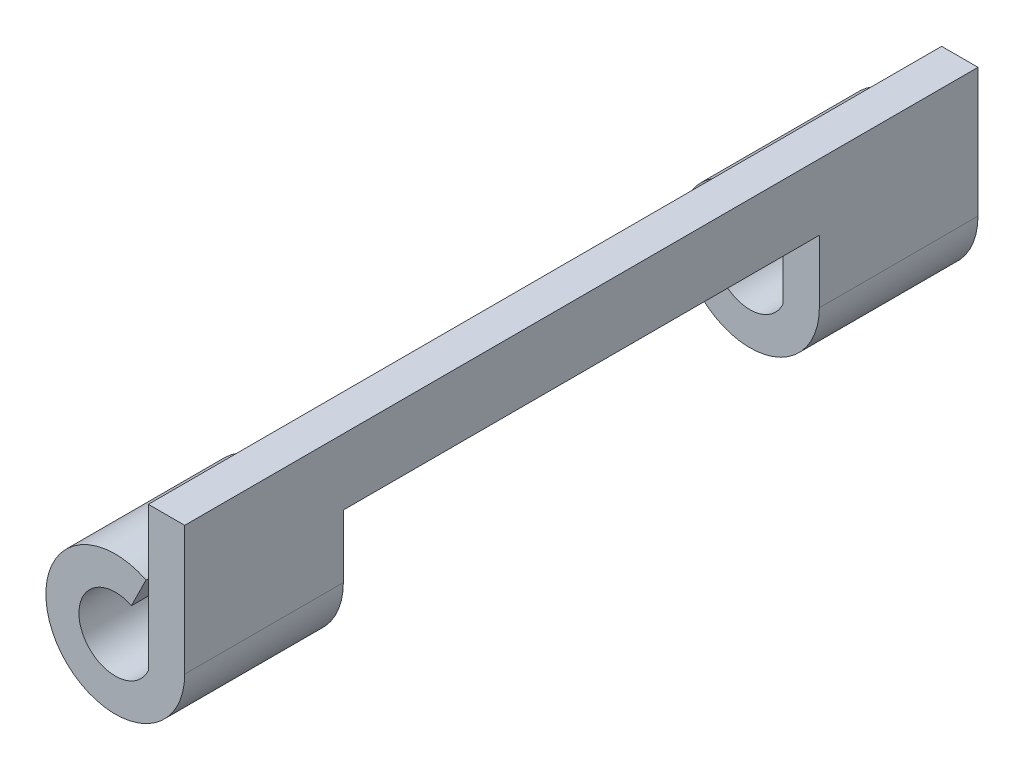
ISO-10303-21;
HEADER;
FILE_DESCRIPTION(('STEP AP214'),'2;1');
FILE_NAME('part.step','',(''),(''),'','','');
FILE_SCHEMA(('AUTOMOTIVE_DESIGN { 1 0 10303 214 1 1 1 1 }'));
ENDSEC;
DATA;
#1=APPLICATION_CONTEXT('core data for automotive mechanical design processes');
#2=APPLICATION_PROTOCOL_DEFINITION('international standard','automotive_design',2000,#1);
#3=PRODUCT_CONTEXT('',#1,'mechanical');
#4=PRODUCT('Part','Part','',(#3));
#5=PRODUCT_RELATED_PRODUCT_CATEGORY('part','',(#4));
#6=PRODUCT_DEFINITION_FORMATION('','',#4);
#7=PRODUCT_DEFINITION_CONTEXT('part definition',#1,'design');
#8=PRODUCT_DEFINITION('design','',#6,#7);
#9=PRODUCT_DEFINITION_SHAPE('','',#8);
#10=(LENGTH_UNIT() NAMED_UNIT(*) SI_UNIT(.MILLI.,.METRE.));
#11=(NAMED_UNIT(*) PLANE_ANGLE_UNIT() SI_UNIT($,.RADIAN.));
#12=(NAMED_UNIT(*) SI_UNIT($,.STERADIAN.) SOLID_ANGLE_UNIT());
#13=UNCERTAINTY_MEASURE_WITH_UNIT(LENGTH_MEASURE(1.E-05),#10,'distance_accuracy_value','');
#14=(GEOMETRIC_REPRESENTATION_CONTEXT(3) GLOBAL_UNCERTAINTY_ASSIGNED_CONTEXT((#13)) GLOBAL_UNIT_ASSIGNED_CONTEXT((#10,
#11,#12)) REPRESENTATION_CONTEXT('',''));
#15=CARTESIAN_POINT('',(0.,0.,0.));
#16=DIRECTION('',(0.,0.,1.));
#17=DIRECTION('',(1.,0.,0.));
#18=AXIS2_PLACEMENT_3D('',#15,#16,#17);
#19=CARTESIAN_POINT('',(0.,0.,60.));
#20=DIRECTION('',(0.,0.,-1.));
#21=DIRECTION('',(-1.,0.,0.));
#22=AXIS2_PLACEMENT_3D('',#19,#20,#21);
#23=CYLINDRICAL_SURFACE('',#22,5.25);
#24=CARTESIAN_POINT('',(0.,0.,12.));
#25=DIRECTION('',(0.,0.,1.));
#26=DIRECTION('',(0.,-1.,0.));
#27=AXIS2_PLACEMENT_3D('',#24,#25,#26);
#28=CIRCLE('',#27,5.25);
#29=CARTESIAN_POINT('',(2.32491484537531,4.70715104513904,12.));
#30=VERTEX_POINT('',#29);
#31=CARTESIAN_POINT('',(5.25,0.,12.));
#32=VERTEX_POINT('',#31);
#33=EDGE_CURVE('E115',#30,#32,#28,.T.);
#34=ORIENTED_EDGE('',*,*,#33,.F.);
#35=DIRECTION('',(0.,0.,-1.));
#36=VECTOR('',#35,1.);
#37=CARTESIAN_POINT('',(2.32491484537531,4.70715104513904,60.));
#38=LINE('',#37,#36);
#39=CARTESIAN_POINT('',(2.32491484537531,4.70715104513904,0.));
#40=VERTEX_POINT('',#39);
#41=EDGE_CURVE('E172',#30,#40,#38,.T.);
#42=ORIENTED_EDGE('',*,*,#41,.T.);
#43=CARTESIAN_POINT('',(0.,0.,0.));
#44=DIRECTION('',(0.,0.,1.));
#45=DIRECTION('',(1.,0.,0.));
#46=AXIS2_PLACEMENT_3D('',#43,#44,#45);
#47=CIRCLE('',#46,5.25);
#48=CARTESIAN_POINT('',(5.25,0.,0.));
#49=VERTEX_POINT('',#48);
#50=EDGE_CURVE('E136',#40,#49,#47,.T.);
#51=ORIENTED_EDGE('',*,*,#50,.T.);
#52=DIRECTION('',(0.,0.,-1.));
#53=VECTOR('',#52,1.);
#54=CARTESIAN_POINT('',(5.25,0.,60.));
#55=LINE('',#54,#53);
#56=EDGE_CURVE('E188',#32,#49,#55,.T.);
#57=ORIENTED_EDGE('',*,*,#56,.F.);
#58=EDGE_LOOP('',(#34,#42,#51,#57));
#59=FACE_BOUND('',#58,.T.);
#60=ADVANCED_FACE('F14',(#59),#23,.T.);
#61=CARTESIAN_POINT('',(2.32491484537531,4.70715104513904,60.));
#62=VERTEX_POINT('',#61);
#63=CARTESIAN_POINT('',(2.32491484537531,4.70715104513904,48.));
#64=VERTEX_POINT('',#63);
#65=EDGE_CURVE('E173',#62,#64,#38,.T.);
#66=ORIENTED_EDGE('',*,*,#65,.T.);
#67=CARTESIAN_POINT('',(0.,0.,48.));
#68=DIRECTION('',(0.,0.,-1.));
#69=DIRECTION('',(-1.,0.,0.));
#70=AXIS2_PLACEMENT_3D('',#67,#68,#69);
#71=CIRCLE('',#70,5.25);
#72=CARTESIAN_POINT('',(5.25,0.,48.));
#73=VERTEX_POINT('',#72);
#74=EDGE_CURVE('E37',#73,#64,#71,.T.);
#75=ORIENTED_EDGE('',*,*,#74,.F.);
#76=CARTESIAN_POINT('',(5.25,0.,60.));
#77=VERTEX_POINT('',#76);
#78=EDGE_CURVE('E189',#77,#73,#55,.T.);
#79=ORIENTED_EDGE('',*,*,#78,.F.);
#80=CARTESIAN_POINT('',(0.,0.,60.));
#81=DIRECTION('',(0.,0.,1.));
#82=DIRECTION('',(1.,0.,0.));
#83=AXIS2_PLACEMENT_3D('',#80,#81,#82);
#84=CIRCLE('',#83,5.25);
#85=EDGE_CURVE('E154',#62,#77,#84,.T.);
#86=ORIENTED_EDGE('',*,*,#85,.F.);
#87=EDGE_LOOP('',(#66,#75,#79,#86));
#88=FACE_BOUND('',#87,.T.);
#89=ADVANCED_FACE('F224',(#88),#23,.T.);
#90=CARTESIAN_POINT('',(5.25,0.,60.));
#91=DIRECTION('',(-1.,0.,0.));
#92=DIRECTION('',(0.,0.,1.));
#93=AXIS2_PLACEMENT_3D('',#90,#91,#92);
#94=PLANE('',#93);
#95=DIRECTION('',(0.,-1.,0.));
#96=VECTOR('',#95,1.);
#97=CARTESIAN_POINT('',(5.25,4.75,12.));
#98=LINE('',#97,#96);
#99=CARTESIAN_POINT('',(5.25,4.75,12.));
#100=VERTEX_POINT('',#99);
#101=EDGE_CURVE('E112',#100,#32,#98,.T.);
#102=ORIENTED_EDGE('',*,*,#101,.T.);
#103=ORIENTED_EDGE('',*,*,#56,.T.);
#104=DIRECTION('',(0.,1.,0.));
#105=VECTOR('',#104,1.);
#106=CARTESIAN_POINT('',(5.25,0.,0.));
#107=LINE('',#106,#105);
#108=CARTESIAN_POINT('',(5.25,9.75,0.));
#109=VERTEX_POINT('',#108);
#110=EDGE_CURVE('E139',#49,#109,#107,.T.);
#111=ORIENTED_EDGE('',*,*,#110,.T.);
#112=DIRECTION('',(0.,0.,-1.));
#113=VECTOR('',#112,1.);
#114=CARTESIAN_POINT('',(5.25,9.75,60.));
#115=LINE('',#114,#113);
#116=CARTESIAN_POINT('',(5.25,9.75,60.));
#117=VERTEX_POINT('',#116);
#118=EDGE_CURVE('E186',#117,#109,#115,.T.);
#119=ORIENTED_EDGE('',*,*,#118,.F.);
#120=DIRECTION('',(0.,1.,0.));
#121=VECTOR('',#120,1.);
#122=CARTESIAN_POINT('',(5.25,0.,60.));
#123=LINE('',#122,#121);
#124=EDGE_CURVE('E157',#77,#117,#123,.T.);
#125=ORIENTED_EDGE('',*,*,#124,.F.);
#126=ORIENTED_EDGE('',*,*,#78,.T.);
#127=DIRECTION('',(0.,1.,0.));
#128=VECTOR('',#127,1.);
#129=CARTESIAN_POINT('',(5.25,-5.25,48.));
#130=LINE('',#129,#128);
#131=CARTESIAN_POINT('',(5.25,4.75,48.));
#132=VERTEX_POINT('',#131);
#133=EDGE_CURVE('E118',#73,#132,#130,.T.);
#134=ORIENTED_EDGE('',*,*,#133,.T.);
#135=DIRECTION('',(0.,0.,-1.));
#136=VECTOR('',#135,1.);
#137=CARTESIAN_POINT('',(5.25,4.75,48.));
#138=LINE('',#137,#136);
#139=EDGE_CURVE('E29',#132,#100,#138,.T.);
#140=ORIENTED_EDGE('',*,*,#139,.T.);
#141=EDGE_LOOP('',(#102,#103,#111,#119,#125,#126,#134,#140));
#142=FACE_BOUND('',#141,.T.);
#143=ADVANCED_FACE('F16',(#142),#94,.F.);
#144=CARTESIAN_POINT('',(2.5,9.75,60.));
#145=DIRECTION('',(1.,0.,0.));
#146=DIRECTION('',(0.,1.,0.));
#147=AXIS2_PLACEMENT_3D('',#144,#145,#146);
#148=PLANE('',#147);
#149=DIRECTION('',(0.,0.,-1.));
#150=VECTOR('',#149,1.);
#151=CARTESIAN_POINT('',(2.5,9.75,60.));
#152=LINE('',#151,#150);
#153=CARTESIAN_POINT('',(2.5,9.75,60.));
#154=VERTEX_POINT('',#153);
#155=CARTESIAN_POINT('',(2.5,9.75,0.));
#156=VERTEX_POINT('',#155);
#157=EDGE_CURVE('E184',#154,#156,#152,.T.);
#158=ORIENTED_EDGE('',*,*,#157,.T.);
#159=DIRECTION('',(0.,-1.,0.));
#160=VECTOR('',#159,1.);
#161=CARTESIAN_POINT('',(2.5,9.75,0.));
#162=LINE('',#161,#160);
#163=CARTESIAN_POINT('',(2.5,-1.14564392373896,0.));
#164=VERTEX_POINT('',#163);
#165=EDGE_CURVE('E145',#156,#164,#162,.T.);
#166=ORIENTED_EDGE('',*,*,#165,.T.);
#167=DIRECTION('',(0.,0.,-1.));
#168=VECTOR('',#167,1.);
#169=CARTESIAN_POINT('',(2.5,-1.14564392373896,60.));
#170=LINE('',#169,#168);
#171=CARTESIAN_POINT('',(2.5,-1.14564392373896,12.));
#172=VERTEX_POINT('',#171);
#173=EDGE_CURVE('E180',#172,#164,#170,.T.);
#174=ORIENTED_EDGE('',*,*,#173,.F.);
#175=DIRECTION('',(0.,-1.,0.));
#176=VECTOR('',#175,1.);
#177=CARTESIAN_POINT('',(2.5,9.75,12.));
#178=LINE('',#177,#176);
#179=CARTESIAN_POINT('',(2.5,4.75,12.));
#180=VERTEX_POINT('',#179);
#181=EDGE_CURVE('E133',#180,#172,#178,.T.);
#182=ORIENTED_EDGE('',*,*,#181,.F.);
#183=DIRECTION('',(0.,0.,-1.));
#184=VECTOR('',#183,1.);
#185=CARTESIAN_POINT('',(2.5,4.75,60.));
#186=LINE('',#185,#184);
#187=CARTESIAN_POINT('',(2.5,4.75,48.));
#188=VERTEX_POINT('',#187);
#189=EDGE_CURVE('E9',#188,#180,#186,.T.);
#190=ORIENTED_EDGE('',*,*,#189,.F.);
#191=DIRECTION('',(0.,1.,0.));
#192=VECTOR('',#191,1.);
#193=CARTESIAN_POINT('',(2.5,9.75,48.));
#194=LINE('',#193,#192);
#195=CARTESIAN_POINT('',(2.5,-1.14564392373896,48.));
#196=VERTEX_POINT('',#195);
#197=EDGE_CURVE('E127',#196,#188,#194,.T.);
#198=ORIENTED_EDGE('',*,*,#197,.F.);
#199=CARTESIAN_POINT('',(2.5,-1.14564392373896,60.));
#200=VERTEX_POINT('',#199);
#201=EDGE_CURVE('E181',#200,#196,#170,.T.);
#202=ORIENTED_EDGE('',*,*,#201,.F.);
#203=DIRECTION('',(0.,-1.,0.));
#204=VECTOR('',#203,1.);
#205=CARTESIAN_POINT('',(2.5,9.75,60.));
#206=LINE('',#205,#204);
#207=EDGE_CURVE('E163',#154,#200,#206,.T.);
#208=ORIENTED_EDGE('',*,*,#207,.F.);
#209=EDGE_LOOP('',(#158,#166,#174,#182,#190,#198,#202,#208));
#210=FACE_BOUND('',#209,.T.);
#211=ADVANCED_FACE('F214',(#210),#148,.F.);
#212=CARTESIAN_POINT('',(0.,0.,60.));
#213=DIRECTION('',(0.,0.,-1.));
#214=DIRECTION('',(-1.,0.,0.));
#215=AXIS2_PLACEMENT_3D('',#212,#213,#214);
#216=CYLINDRICAL_SURFACE('',#215,2.75);
#217=DIRECTION('',(0.,0.,-1.));
#218=VECTOR('',#217,1.);
#219=CARTESIAN_POINT('',(1.21781253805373,2.46565054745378,60.));
#220=LINE('',#219,#218);
#221=CARTESIAN_POINT('',(1.21781253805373,2.46565054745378,12.));
#222=VERTEX_POINT('',#221);
#223=CARTESIAN_POINT('',(1.21781253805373,2.46565054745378,0.));
#224=VERTEX_POINT('',#223);
#225=EDGE_CURVE('E176',#222,#224,#220,.T.);
#226=ORIENTED_EDGE('',*,*,#225,.F.);
#227=CARTESIAN_POINT('',(0.,0.,12.));
#228=DIRECTION('',(0.,0.,1.));
#229=DIRECTION('',(0.,-1.,0.));
#230=AXIS2_PLACEMENT_3D('',#227,#228,#229);
#231=CIRCLE('',#230,2.75);
#232=EDGE_CURVE('E130',#222,#172,#231,.T.);
#233=ORIENTED_EDGE('',*,*,#232,.T.);
#234=ORIENTED_EDGE('',*,*,#173,.T.);
#235=CARTESIAN_POINT('',(0.,0.,0.));
#236=DIRECTION('',(0.,0.,1.));
#237=DIRECTION('',(1.,0.,0.));
#238=AXIS2_PLACEMENT_3D('',#235,#236,#237);
#239=CIRCLE('',#238,2.75);
#240=EDGE_CURVE('E148',#224,#164,#239,.T.);
#241=ORIENTED_EDGE('',*,*,#240,.F.);
#242=EDGE_LOOP('',(#226,#233,#234,#241));
#243=FACE_BOUND('',#242,.T.);
#244=ADVANCED_FACE('F227',(#243),#216,.F.);
#245=ORIENTED_EDGE('',*,*,#201,.T.);
#246=CARTESIAN_POINT('',(0.,0.,48.));
#247=DIRECTION('',(0.,0.,-1.));
#248=DIRECTION('',(-1.,0.,0.));
#249=AXIS2_PLACEMENT_3D('',#246,#247,#248);
#250=CIRCLE('',#249,2.75);
#251=CARTESIAN_POINT('',(1.21781253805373,2.46565054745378,48.));
#252=VERTEX_POINT('',#251);
#253=EDGE_CURVE('E108',#196,#252,#250,.T.);
#254=ORIENTED_EDGE('',*,*,#253,.T.);
#255=CARTESIAN_POINT('',(1.21781253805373,2.46565054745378,60.));
#256=VERTEX_POINT('',#255);
#257=EDGE_CURVE('E177',#256,#252,#220,.T.);
#258=ORIENTED_EDGE('',*,*,#257,.F.);
#259=CARTESIAN_POINT('',(0.,0.,60.));
#260=DIRECTION('',(0.,0.,1.));
#261=DIRECTION('',(1.,0.,0.));
#262=AXIS2_PLACEMENT_3D('',#259,#260,#261);
#263=CIRCLE('',#262,2.75);
#264=EDGE_CURVE('E166',#256,#200,#263,.T.);
#265=ORIENTED_EDGE('',*,*,#264,.T.);
#266=EDGE_LOOP('',(#245,#254,#258,#265));
#267=FACE_BOUND('',#266,.T.);
#268=ADVANCED_FACE('F220',(#267),#216,.F.);
#269=CARTESIAN_POINT('',(1.21781253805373,2.46565054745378,60.));
#270=DIRECTION('',(-0.896600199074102,0.44284092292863,0.));
#271=DIRECTION('',(-0.44284092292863,-0.896600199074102,0.));
#272=AXIS2_PLACEMENT_3D('',#269,#270,#271);
#273=PLANE('',#272);
#274=DIRECTION('',(0.44284092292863,0.896600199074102,0.));
#275=VECTOR('',#274,1.);
#276=CARTESIAN_POINT('',(1.21781253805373,2.46565054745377,12.));
#277=LINE('',#276,#275);
#278=EDGE_CURVE('E22',#222,#30,#277,.T.);
#279=ORIENTED_EDGE('',*,*,#278,.F.);
#280=ORIENTED_EDGE('',*,*,#225,.T.);
#281=DIRECTION('',(0.44284092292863,0.896600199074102,0.));
#282=VECTOR('',#281,1.);
#283=CARTESIAN_POINT('',(1.21781253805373,2.46565054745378,0.));
#284=LINE('',#283,#282);
#285=EDGE_CURVE('E151',#224,#40,#284,.T.);
#286=ORIENTED_EDGE('',*,*,#285,.T.);
#287=ORIENTED_EDGE('',*,*,#41,.F.);
#288=EDGE_LOOP('',(#279,#280,#286,#287));
#289=FACE_BOUND('',#288,.T.);
#290=ADVANCED_FACE('F196',(#289),#273,.F.);
#291=DIRECTION('',(-0.44284092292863,-0.896600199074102,0.));
#292=VECTOR('',#291,1.);
#293=CARTESIAN_POINT('',(1.21781253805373,2.46565054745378,48.));
#294=LINE('',#293,#292);
#295=EDGE_CURVE('E191',#64,#252,#294,.T.);
#296=ORIENTED_EDGE('',*,*,#295,.F.);
#297=ORIENTED_EDGE('',*,*,#65,.F.);
#298=DIRECTION('',(0.44284092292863,0.896600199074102,0.));
#299=VECTOR('',#298,1.);
#300=CARTESIAN_POINT('',(1.21781253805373,2.46565054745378,60.));
#301=LINE('',#300,#299);
#302=EDGE_CURVE('E169',#256,#62,#301,.T.);
#303=ORIENTED_EDGE('',*,*,#302,.F.);
#304=ORIENTED_EDGE('',*,*,#257,.T.);
#305=EDGE_LOOP('',(#296,#297,#303,#304));
#306=FACE_BOUND('',#305,.T.);
#307=ADVANCED_FACE('F222',(#306),#273,.F.);
#308=CARTESIAN_POINT('',(2.5,9.75,60.));
#309=DIRECTION('',(0.,1.,0.));
#310=DIRECTION('',(0.,0.,1.));
#311=AXIS2_PLACEMENT_3D('',#308,#309,#310);
#312=PLANE('',#311);
#313=ORIENTED_EDGE('',*,*,#157,.F.);
#314=DIRECTION('',(1.,0.,0.));
#315=VECTOR('',#314,1.);
#316=CARTESIAN_POINT('',(2.5,9.75,60.));
#317=LINE('',#316,#315);
#318=EDGE_CURVE('E160',#154,#117,#317,.T.);
#319=ORIENTED_EDGE('',*,*,#318,.T.);
#320=ORIENTED_EDGE('',*,*,#118,.T.);
#321=DIRECTION('',(1.,0.,0.));
#322=VECTOR('',#321,1.);
#323=CARTESIAN_POINT('',(2.5,9.75,0.));
#324=LINE('',#323,#322);
#325=EDGE_CURVE('E142',#156,#109,#324,.T.);
#326=ORIENTED_EDGE('',*,*,#325,.F.);
#327=EDGE_LOOP('',(#313,#319,#320,#326));
#328=FACE_BOUND('',#327,.T.);
#329=ADVANCED_FACE('F212',(#328),#312,.T.);
#330=CARTESIAN_POINT('',(0.,0.,60.));
#331=DIRECTION('',(0.,0.,1.));
#332=DIRECTION('',(1.,0.,0.));
#333=AXIS2_PLACEMENT_3D('',#330,#331,#332);
#334=PLANE('',#333);
#335=ORIENTED_EDGE('',*,*,#85,.T.);
#336=ORIENTED_EDGE('',*,*,#124,.T.);
#337=ORIENTED_EDGE('',*,*,#318,.F.);
#338=ORIENTED_EDGE('',*,*,#207,.T.);
#339=ORIENTED_EDGE('',*,*,#264,.F.);
#340=ORIENTED_EDGE('',*,*,#302,.T.);
#341=EDGE_LOOP('',(#335,#336,#337,#338,#339,#340));
#342=FACE_BOUND('',#341,.T.);
#343=ADVANCED_FACE('F209',(#342),#334,.T.);
#344=CARTESIAN_POINT('',(0.,0.,0.));
#345=DIRECTION('',(0.,0.,1.));
#346=DIRECTION('',(1.,0.,0.));
#347=AXIS2_PLACEMENT_3D('',#344,#345,#346);
#348=PLANE('',#347);
#349=ORIENTED_EDGE('',*,*,#50,.F.);
#350=ORIENTED_EDGE('',*,*,#285,.F.);
#351=ORIENTED_EDGE('',*,*,#240,.T.);
#352=ORIENTED_EDGE('',*,*,#165,.F.);
#353=ORIENTED_EDGE('',*,*,#325,.T.);
#354=ORIENTED_EDGE('',*,*,#110,.F.);
#355=EDGE_LOOP('',(#349,#350,#351,#352,#353,#354));
#356=FACE_BOUND('',#355,.T.);
#357=ADVANCED_FACE('F202',(#356),#348,.F.);
#358=CARTESIAN_POINT('',(-5.25,4.75,48.));
#359=DIRECTION('',(0.,-1.,0.));
#360=DIRECTION('',(0.,0.,-1.));
#361=AXIS2_PLACEMENT_3D('',#358,#359,#360);
#362=PLANE('',#361);
#363=ORIENTED_EDGE('',*,*,#189,.T.);
#364=DIRECTION('',(1.,0.,0.));
#365=VECTOR('',#364,1.);
#366=CARTESIAN_POINT('',(-5.25,4.75,12.));
#367=LINE('',#366,#365);
#368=EDGE_CURVE('E102',#180,#100,#367,.T.);
#369=ORIENTED_EDGE('',*,*,#368,.T.);
#370=ORIENTED_EDGE('',*,*,#139,.F.);
#371=DIRECTION('',(1.,0.,0.));
#372=VECTOR('',#371,1.);
#373=CARTESIAN_POINT('',(-5.25,4.75,48.));
#374=LINE('',#373,#372);
#375=EDGE_CURVE('E109',#188,#132,#374,.T.);
#376=ORIENTED_EDGE('',*,*,#375,.F.);
#377=EDGE_LOOP('',(#363,#369,#370,#376));
#378=FACE_BOUND('',#377,.T.);
#379=ADVANCED_FACE('F104',(#378),#362,.T.);
#380=CARTESIAN_POINT('',(-5.25,4.75,12.));
#381=DIRECTION('',(0.,0.,1.));
#382=DIRECTION('',(0.,-1.,0.));
#383=AXIS2_PLACEMENT_3D('',#380,#381,#382);
#384=PLANE('',#383);
#385=ORIENTED_EDGE('',*,*,#33,.T.);
#386=ORIENTED_EDGE('',*,*,#101,.F.);
#387=ORIENTED_EDGE('',*,*,#368,.F.);
#388=ORIENTED_EDGE('',*,*,#181,.T.);
#389=ORIENTED_EDGE('',*,*,#232,.F.);
#390=ORIENTED_EDGE('',*,*,#278,.T.);
#391=EDGE_LOOP('',(#385,#386,#387,#388,#389,#390));
#392=FACE_BOUND('',#391,.T.);
#393=ADVANCED_FACE('F113',(#392),#384,.T.);
#394=CARTESIAN_POINT('',(-5.25,-5.25,48.));
#395=DIRECTION('',(0.,0.,-1.));
#396=DIRECTION('',(-1.,0.,0.));
#397=AXIS2_PLACEMENT_3D('',#394,#395,#396);
#398=PLANE('',#397);
#399=ORIENTED_EDGE('',*,*,#295,.T.);
#400=ORIENTED_EDGE('',*,*,#253,.F.);
#401=ORIENTED_EDGE('',*,*,#197,.T.);
#402=ORIENTED_EDGE('',*,*,#375,.T.);
#403=ORIENTED_EDGE('',*,*,#133,.F.);
#404=ORIENTED_EDGE('',*,*,#74,.T.);
#405=EDGE_LOOP('',(#399,#400,#401,#402,#403,#404));
#406=FACE_BOUND('',#405,.T.);
#407=ADVANCED_FACE('F225',(#406),#398,.T.);
#408=CLOSED_SHELL('',(#60,#89,#143,#211,#244,#268,#290,#307,#329,#343,#357,#379,#393,#407));
#409=MANIFOLD_SOLID_BREP('B1',#408);
#410=ADVANCED_BREP_SHAPE_REPRESENTATION('',(#18,#409),#14);
#411=SHAPE_DEFINITION_REPRESENTATION(#9,#410);
ENDSEC;
END-ISO-10303-21;
